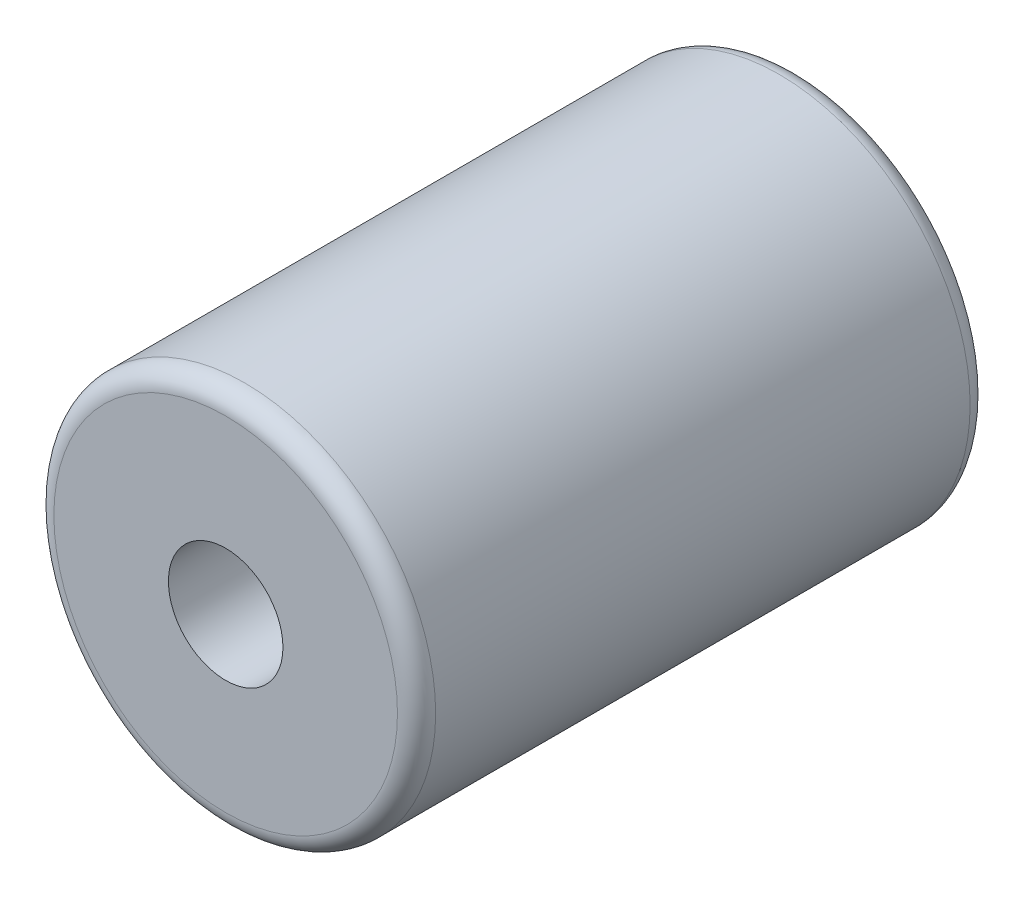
ISO-10303-21;
HEADER;
FILE_DESCRIPTION(('STEP AP214'),'2;1');
FILE_NAME('part.step','',(''),(''),'','','');
FILE_SCHEMA(('AUTOMOTIVE_DESIGN { 1 0 10303 214 1 1 1 1 }'));
ENDSEC;
DATA;
#1=APPLICATION_CONTEXT('core data for automotive mechanical design processes');
#2=APPLICATION_PROTOCOL_DEFINITION('international standard','automotive_design',2000,#1);
#3=PRODUCT_CONTEXT('',#1,'mechanical');
#4=PRODUCT('Part','Part','',(#3));
#5=PRODUCT_RELATED_PRODUCT_CATEGORY('part','',(#4));
#6=PRODUCT_DEFINITION_FORMATION('','',#4);
#7=PRODUCT_DEFINITION_CONTEXT('part definition',#1,'design');
#8=PRODUCT_DEFINITION('design','',#6,#7);
#9=PRODUCT_DEFINITION_SHAPE('','',#8);
#10=(LENGTH_UNIT() NAMED_UNIT(*) SI_UNIT(.MILLI.,.METRE.));
#11=(NAMED_UNIT(*) PLANE_ANGLE_UNIT() SI_UNIT($,.RADIAN.));
#12=(NAMED_UNIT(*) SI_UNIT($,.STERADIAN.) SOLID_ANGLE_UNIT());
#13=UNCERTAINTY_MEASURE_WITH_UNIT(LENGTH_MEASURE(1.E-05),#10,'distance_accuracy_value','');
#14=(GEOMETRIC_REPRESENTATION_CONTEXT(3) GLOBAL_UNCERTAINTY_ASSIGNED_CONTEXT((#13)) GLOBAL_UNIT_ASSIGNED_CONTEXT((#10,
#11,#12)) REPRESENTATION_CONTEXT('',''));
#15=CARTESIAN_POINT('',(0.,0.,0.));
#16=DIRECTION('',(0.,0.,1.));
#17=DIRECTION('',(1.,0.,0.));
#18=AXIS2_PLACEMENT_3D('',#15,#16,#17);
#19=CARTESIAN_POINT('',(-206.59355070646,311.364414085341,27.));
#20=DIRECTION('',(0.,0.,1.));
#21=DIRECTION('',(1.,0.,0.));
#22=AXIS2_PLACEMENT_3D('',#19,#20,#21);
#23=PLANE('',#22);
#24=CARTESIAN_POINT('',(-206.59355070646,311.364414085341,27.));
#25=DIRECTION('',(0.,0.,1.));
#26=DIRECTION('',(1.,0.,0.));
#27=AXIS2_PLACEMENT_3D('',#24,#25,#26);
#28=CIRCLE('',#27,4.50000000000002);
#29=CARTESIAN_POINT('',(-202.09355070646,311.364414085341,27.));
#30=VERTEX_POINT('',#29);
#31=EDGE_CURVE('E10',#30,#30,#28,.T.);
#32=ORIENTED_EDGE('',*,*,#31,.T.);
#33=EDGE_LOOP('',(#32));
#34=FACE_BOUND('',#33,.T.);
#35=CARTESIAN_POINT('',(-206.59355070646,311.364414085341,27.));
#36=DIRECTION('',(0.,0.,1.));
#37=DIRECTION('',(1.,0.,0.));
#38=AXIS2_PLACEMENT_3D('',#35,#36,#37);
#39=CIRCLE('',#38,1.5);
#40=CARTESIAN_POINT('',(-205.09355070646,311.364414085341,27.));
#41=VERTEX_POINT('',#40);
#42=EDGE_CURVE('E52',#41,#41,#39,.T.);
#43=ORIENTED_EDGE('',*,*,#42,.F.);
#44=EDGE_LOOP('',(#43));
#45=FACE_BOUND('',#44,.T.);
#46=ADVANCED_FACE('F32',(#34,#45),#23,.T.);
#47=CARTESIAN_POINT('',(-206.59355070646,311.364414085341,12.));
#48=DIRECTION('',(0.,0.,1.));
#49=DIRECTION('',(1.,0.,0.));
#50=AXIS2_PLACEMENT_3D('',#47,#48,#49);
#51=PLANE('',#50);
#52=CARTESIAN_POINT('',(-206.59355070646,311.364414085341,12.));
#53=DIRECTION('',(0.,0.,1.));
#54=DIRECTION('',(1.,0.,0.));
#55=AXIS2_PLACEMENT_3D('',#52,#53,#54);
#56=CIRCLE('',#55,4.50000000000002);
#57=CARTESIAN_POINT('',(-202.09355070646,311.364414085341,12.));
#58=VERTEX_POINT('',#57);
#59=EDGE_CURVE('E39',#58,#58,#56,.F.);
#60=ORIENTED_EDGE('',*,*,#59,.T.);
#61=EDGE_LOOP('',(#60));
#62=FACE_BOUND('',#61,.T.);
#63=CARTESIAN_POINT('',(-206.59355070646,311.364414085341,12.));
#64=DIRECTION('',(0.,0.,1.));
#65=DIRECTION('',(1.,0.,0.));
#66=AXIS2_PLACEMENT_3D('',#63,#64,#65);
#67=CIRCLE('',#66,1.5);
#68=CARTESIAN_POINT('',(-205.09355070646,311.364414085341,12.));
#69=VERTEX_POINT('',#68);
#70=EDGE_CURVE('E53',#69,#69,#67,.T.);
#71=ORIENTED_EDGE('',*,*,#70,.T.);
#72=EDGE_LOOP('',(#71));
#73=FACE_BOUND('',#72,.T.);
#74=ADVANCED_FACE('F63',(#62,#73),#51,.F.);
#75=CARTESIAN_POINT('',(-206.59355070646,311.364414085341,27.));
#76=DIRECTION('',(0.,0.,-1.));
#77=DIRECTION('',(-1.,0.,0.));
#78=AXIS2_PLACEMENT_3D('',#75,#76,#77);
#79=CYLINDRICAL_SURFACE('',#78,5.00000000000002);
#80=CARTESIAN_POINT('',(-206.59355070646,311.364414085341,12.5));
#81=DIRECTION('',(0.,0.,1.));
#82=DIRECTION('',(1.,0.,0.));
#83=AXIS2_PLACEMENT_3D('',#80,#81,#82);
#84=CIRCLE('',#83,5.00000000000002);
#85=CARTESIAN_POINT('',(-201.59355070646,311.364414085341,12.5));
#86=VERTEX_POINT('',#85);
#87=EDGE_CURVE('E43',#86,#86,#84,.T.);
#88=ORIENTED_EDGE('',*,*,#87,.T.);
#89=EDGE_LOOP('',(#88));
#90=FACE_BOUND('',#89,.T.);
#91=CARTESIAN_POINT('',(-206.59355070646,311.364414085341,26.5));
#92=DIRECTION('',(0.,0.,1.));
#93=DIRECTION('',(1.,0.,0.));
#94=AXIS2_PLACEMENT_3D('',#91,#92,#93);
#95=CIRCLE('',#94,5.00000000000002);
#96=CARTESIAN_POINT('',(-201.59355070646,311.364414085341,26.5));
#97=VERTEX_POINT('',#96);
#98=EDGE_CURVE('E47',#97,#97,#95,.F.);
#99=ORIENTED_EDGE('',*,*,#98,.T.);
#100=EDGE_LOOP('',(#99));
#101=FACE_BOUND('',#100,.T.);
#102=ADVANCED_FACE('F68',(#90,#101),#79,.T.);
#103=CARTESIAN_POINT('',(-206.59355070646,311.364414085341,27.));
#104=DIRECTION('',(0.,0.,-1.));
#105=DIRECTION('',(-1.,0.,0.));
#106=AXIS2_PLACEMENT_3D('',#103,#104,#105);
#107=CYLINDRICAL_SURFACE('',#106,1.5);
#108=ORIENTED_EDGE('',*,*,#42,.T.);
#109=EDGE_LOOP('',(#108));
#110=FACE_BOUND('',#109,.T.);
#111=ORIENTED_EDGE('',*,*,#70,.F.);
#112=EDGE_LOOP('',(#111));
#113=FACE_BOUND('',#112,.T.);
#114=ADVANCED_FACE('F59',(#110,#113),#107,.F.);
#115=CARTESIAN_POINT('',(-206.59355070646,311.364414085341,12.5));
#116=DIRECTION('',(0.,0.,1.));
#117=DIRECTION('',(1.,0.,0.));
#118=AXIS2_PLACEMENT_3D('',#115,#116,#117);
#119=TOROIDAL_SURFACE('',#118,4.50000000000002,0.5);
#120=ORIENTED_EDGE('',*,*,#59,.F.);
#121=EDGE_LOOP('',(#120));
#122=FACE_BOUND('',#121,.T.);
#123=ORIENTED_EDGE('',*,*,#87,.F.);
#124=EDGE_LOOP('',(#123));
#125=FACE_BOUND('',#124,.T.);
#126=ADVANCED_FACE('F74',(#122,#125),#119,.T.);
#127=CARTESIAN_POINT('',(-206.59355070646,311.364414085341,26.5));
#128=DIRECTION('',(0.,0.,1.));
#129=DIRECTION('',(1.,0.,0.));
#130=AXIS2_PLACEMENT_3D('',#127,#128,#129);
#131=TOROIDAL_SURFACE('',#130,4.50000000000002,0.5);
#132=ORIENTED_EDGE('',*,*,#98,.F.);
#133=EDGE_LOOP('',(#132));
#134=FACE_BOUND('',#133,.T.);
#135=ORIENTED_EDGE('',*,*,#31,.F.);
#136=EDGE_LOOP('',(#135));
#137=FACE_BOUND('',#136,.T.);
#138=ADVANCED_FACE('F34',(#134,#137),#131,.T.);
#139=CLOSED_SHELL('',(#46,#74,#102,#114,#126,#138));
#140=MANIFOLD_SOLID_BREP('B2',#139);
#141=ADVANCED_BREP_SHAPE_REPRESENTATION('',(#18,#140),#14);
#142=SHAPE_DEFINITION_REPRESENTATION(#9,#141);
ENDSEC;
END-ISO-10303-21;
